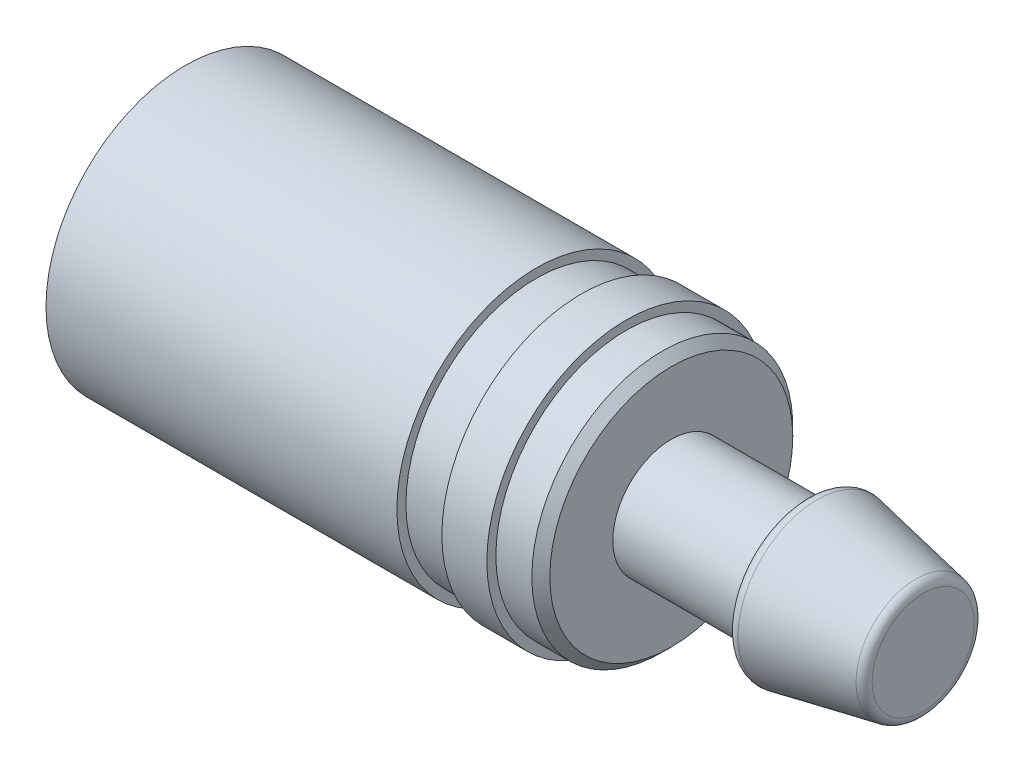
ISO-10303-21;
HEADER;
FILE_DESCRIPTION(('STEP AP214'),'2;1');
FILE_NAME('part.step','',(''),(''),'','','');
FILE_SCHEMA(('AUTOMOTIVE_DESIGN { 1 0 10303 214 1 1 1 1 }'));
ENDSEC;
DATA;
#1=APPLICATION_CONTEXT('core data for automotive mechanical design processes');
#2=APPLICATION_PROTOCOL_DEFINITION('international standard','automotive_design',2000,#1);
#3=PRODUCT_CONTEXT('',#1,'mechanical');
#4=PRODUCT('Part','Part','',(#3));
#5=PRODUCT_RELATED_PRODUCT_CATEGORY('part','',(#4));
#6=PRODUCT_DEFINITION_FORMATION('','',#4);
#7=PRODUCT_DEFINITION_CONTEXT('part definition',#1,'design');
#8=PRODUCT_DEFINITION('design','',#6,#7);
#9=PRODUCT_DEFINITION_SHAPE('','',#8);
#10=(LENGTH_UNIT() NAMED_UNIT(*) SI_UNIT(.MILLI.,.METRE.));
#11=(NAMED_UNIT(*) PLANE_ANGLE_UNIT() SI_UNIT($,.RADIAN.));
#12=(NAMED_UNIT(*) SI_UNIT($,.STERADIAN.) SOLID_ANGLE_UNIT());
#13=UNCERTAINTY_MEASURE_WITH_UNIT(LENGTH_MEASURE(1.E-05),#10,'distance_accuracy_value','');
#14=(GEOMETRIC_REPRESENTATION_CONTEXT(3) GLOBAL_UNCERTAINTY_ASSIGNED_CONTEXT((#13)) GLOBAL_UNIT_ASSIGNED_CONTEXT((#10,
#11,#12)) REPRESENTATION_CONTEXT('',''));
#15=CARTESIAN_POINT('',(0.,0.,0.));
#16=DIRECTION('',(0.,0.,1.));
#17=DIRECTION('',(1.,0.,0.));
#18=AXIS2_PLACEMENT_3D('',#15,#16,#17);
#19=CARTESIAN_POINT('',(82.,0.,0.));
#20=DIRECTION('',(-1.,0.,0.));
#21=DIRECTION('',(0.,0.,1.));
#22=AXIS2_PLACEMENT_3D('',#19,#20,#21);
#23=PLANE('',#22);
#24=CARTESIAN_POINT('',(82.,0.,0.));
#25=DIRECTION('',(-1.,0.,0.));
#26=DIRECTION('',(0.,0.,1.));
#27=AXIS2_PLACEMENT_3D('',#24,#25,#26);
#28=CIRCLE('',#27,5.67398443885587);
#29=CARTESIAN_POINT('',(82.,0.,5.67398443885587));
#30=VERTEX_POINT('',#29);
#31=EDGE_CURVE('E46',#30,#30,#28,.F.);
#32=ORIENTED_EDGE('',*,*,#31,.T.);
#33=EDGE_LOOP('',(#32));
#34=FACE_BOUND('',#33,.T.);
#35=ADVANCED_FACE('F31',(#34),#23,.F.);
#36=CARTESIAN_POINT('',(82.,0.,0.));
#37=DIRECTION('',(-1.,0.,0.));
#38=DIRECTION('',(0.,0.,1.));
#39=AXIS2_PLACEMENT_3D('',#36,#37,#38);
#40=CONICAL_SURFACE('',#39,6.5,0.189988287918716);
#41=CARTESIAN_POINT('',(81.1888473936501,0.,0.));
#42=DIRECTION('',(1.,0.,0.));
#43=DIRECTION('',(0.,0.,-1.));
#44=AXIS2_PLACEMENT_3D('',#41,#42,#43);
#45=CIRCLE('',#44,6.65599088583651);
#46=CARTESIAN_POINT('',(81.1888473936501,0.,-6.65599088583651));
#47=VERTEX_POINT('',#46);
#48=EDGE_CURVE('E51',#47,#47,#45,.F.);
#49=ORIENTED_EDGE('',*,*,#48,.T.);
#50=EDGE_LOOP('',(#49));
#51=FACE_BOUND('',#50,.T.);
#52=CARTESIAN_POINT('',(70.1888473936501,0.,0.));
#53=DIRECTION('',(1.,0.,0.));
#54=DIRECTION('',(0.,0.,-1.));
#55=AXIS2_PLACEMENT_3D('',#52,#53,#54);
#56=CIRCLE('',#55,8.77137550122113);
#57=CARTESIAN_POINT('',(70.1888473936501,0.,-8.77137550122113));
#58=VERTEX_POINT('',#57);
#59=EDGE_CURVE('E54',#58,#58,#56,.T.);
#60=ORIENTED_EDGE('',*,*,#59,.T.);
#61=EDGE_LOOP('',(#60));
#62=FACE_BOUND('',#61,.T.);
#63=ADVANCED_FACE('F133',(#51,#62),#40,.T.);
#64=CARTESIAN_POINT('',(69.,6.5,0.));
#65=DIRECTION('',(1.,0.,0.));
#66=DIRECTION('',(0.,0.,-1.));
#67=AXIS2_PLACEMENT_3D('',#64,#65,#66);
#68=PLANE('',#67);
#69=CARTESIAN_POINT('',(69.,0.,0.));
#70=DIRECTION('',(1.,0.,0.));
#71=DIRECTION('',(0.,0.,-1.));
#72=AXIS2_PLACEMENT_3D('',#69,#70,#71);
#73=CIRCLE('',#72,7.78936905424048);
#74=CARTESIAN_POINT('',(69.,0.,-7.78936905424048));
#75=VERTEX_POINT('',#74);
#76=EDGE_CURVE('E42',#75,#75,#73,.F.);
#77=ORIENTED_EDGE('',*,*,#76,.T.);
#78=EDGE_LOOP('',(#77));
#79=FACE_BOUND('',#78,.T.);
#80=CARTESIAN_POINT('',(69.,0.,0.));
#81=DIRECTION('',(-1.,0.,0.));
#82=DIRECTION('',(0.,0.,1.));
#83=AXIS2_PLACEMENT_3D('',#80,#81,#82);
#84=CIRCLE('',#83,6.5);
#85=CARTESIAN_POINT('',(69.,0.,6.5));
#86=VERTEX_POINT('',#85);
#87=EDGE_CURVE('E57',#86,#86,#84,.T.);
#88=ORIENTED_EDGE('',*,*,#87,.F.);
#89=EDGE_LOOP('',(#88));
#90=FACE_BOUND('',#89,.T.);
#91=ADVANCED_FACE('F139',(#79,#90),#68,.F.);
#92=CARTESIAN_POINT('',(0.,0.,0.));
#93=DIRECTION('',(-1.,0.,0.));
#94=DIRECTION('',(0.,0.,1.));
#95=AXIS2_PLACEMENT_3D('',#92,#93,#94);
#96=CYLINDRICAL_SURFACE('',#95,6.5);
#97=CARTESIAN_POINT('',(54.,0.,0.));
#98=DIRECTION('',(-1.,0.,0.));
#99=DIRECTION('',(0.,0.,1.));
#100=AXIS2_PLACEMENT_3D('',#97,#98,#99);
#101=CIRCLE('',#100,6.5);
#102=CARTESIAN_POINT('',(54.,0.,6.5));
#103=VERTEX_POINT('',#102);
#104=EDGE_CURVE('E60',#103,#103,#101,.T.);
#105=ORIENTED_EDGE('',*,*,#104,.F.);
#106=EDGE_LOOP('',(#105));
#107=FACE_BOUND('',#106,.T.);
#108=ORIENTED_EDGE('',*,*,#87,.T.);
#109=EDGE_LOOP('',(#108));
#110=FACE_BOUND('',#109,.T.);
#111=ADVANCED_FACE('F130',(#107,#110),#96,.T.);
#112=CARTESIAN_POINT('',(54.,14.5,0.));
#113=DIRECTION('',(-1.,0.,0.));
#114=DIRECTION('',(0.,0.,1.));
#115=AXIS2_PLACEMENT_3D('',#112,#113,#114);
#116=PLANE('',#115);
#117=CARTESIAN_POINT('',(54.,0.,0.));
#118=DIRECTION('',(-1.,0.,0.));
#119=DIRECTION('',(0.,0.,1.));
#120=AXIS2_PLACEMENT_3D('',#117,#118,#119);
#121=CIRCLE('',#120,13.5);
#122=CARTESIAN_POINT('',(54.,0.,13.5));
#123=VERTEX_POINT('',#122);
#124=EDGE_CURVE('E10',#123,#123,#121,.F.);
#125=ORIENTED_EDGE('',*,*,#124,.T.);
#126=EDGE_LOOP('',(#125));
#127=FACE_BOUND('',#126,.T.);
#128=ORIENTED_EDGE('',*,*,#104,.T.);
#129=EDGE_LOOP('',(#128));
#130=FACE_BOUND('',#129,.T.);
#131=ADVANCED_FACE('F125',(#127,#130),#116,.F.);
#132=CARTESIAN_POINT('',(0.,0.,0.));
#133=DIRECTION('',(-1.,0.,0.));
#134=DIRECTION('',(0.,0.,1.));
#135=AXIS2_PLACEMENT_3D('',#132,#133,#134);
#136=CYLINDRICAL_SURFACE('',#135,14.5);
#137=CARTESIAN_POINT('',(53.,0.,0.));
#138=DIRECTION('',(-1.,0.,0.));
#139=DIRECTION('',(0.,0.,1.));
#140=AXIS2_PLACEMENT_3D('',#137,#138,#139);
#141=CIRCLE('',#140,14.5);
#142=CARTESIAN_POINT('',(53.,0.,14.5));
#143=VERTEX_POINT('',#142);
#144=EDGE_CURVE('E38',#143,#143,#141,.T.);
#145=ORIENTED_EDGE('',*,*,#144,.T.);
#146=EDGE_LOOP('',(#145));
#147=FACE_BOUND('',#146,.T.);
#148=CARTESIAN_POINT('',(49.,0.,0.));
#149=DIRECTION('',(-1.,0.,0.));
#150=DIRECTION('',(0.,0.,1.));
#151=AXIS2_PLACEMENT_3D('',#148,#149,#150);
#152=CIRCLE('',#151,14.5);
#153=CARTESIAN_POINT('',(49.,0.,14.5));
#154=VERTEX_POINT('',#153);
#155=EDGE_CURVE('E63',#154,#154,#152,.T.);
#156=ORIENTED_EDGE('',*,*,#155,.F.);
#157=EDGE_LOOP('',(#156));
#158=FACE_BOUND('',#157,.T.);
#159=ADVANCED_FACE('F120',(#147,#158),#136,.T.);
#160=CARTESIAN_POINT('',(49.,15.5,0.));
#161=DIRECTION('',(-1.,0.,0.));
#162=DIRECTION('',(0.,0.,1.));
#163=AXIS2_PLACEMENT_3D('',#160,#161,#162);
#164=PLANE('',#163);
#165=CARTESIAN_POINT('',(49.,0.,0.));
#166=DIRECTION('',(-1.,0.,0.));
#167=DIRECTION('',(0.,0.,1.));
#168=AXIS2_PLACEMENT_3D('',#165,#166,#167);
#169=CIRCLE('',#168,15.5);
#170=CARTESIAN_POINT('',(49.,0.,15.5));
#171=VERTEX_POINT('',#170);
#172=EDGE_CURVE('E66',#171,#171,#169,.T.);
#173=ORIENTED_EDGE('',*,*,#172,.F.);
#174=EDGE_LOOP('',(#173));
#175=FACE_BOUND('',#174,.T.);
#176=ORIENTED_EDGE('',*,*,#155,.T.);
#177=EDGE_LOOP('',(#176));
#178=FACE_BOUND('',#177,.T.);
#179=ADVANCED_FACE('F114',(#175,#178),#164,.F.);
#180=CARTESIAN_POINT('',(0.,0.,0.));
#181=DIRECTION('',(-1.,0.,0.));
#182=DIRECTION('',(0.,0.,1.));
#183=AXIS2_PLACEMENT_3D('',#180,#181,#182);
#184=CYLINDRICAL_SURFACE('',#183,15.5);
#185=CARTESIAN_POINT('',(44.,0.,0.));
#186=DIRECTION('',(-1.,0.,0.));
#187=DIRECTION('',(0.,0.,1.));
#188=AXIS2_PLACEMENT_3D('',#185,#186,#187);
#189=CIRCLE('',#188,15.5);
#190=CARTESIAN_POINT('',(44.,0.,15.5));
#191=VERTEX_POINT('',#190);
#192=EDGE_CURVE('E69',#191,#191,#189,.T.);
#193=ORIENTED_EDGE('',*,*,#192,.F.);
#194=EDGE_LOOP('',(#193));
#195=FACE_BOUND('',#194,.T.);
#196=ORIENTED_EDGE('',*,*,#172,.T.);
#197=EDGE_LOOP('',(#196));
#198=FACE_BOUND('',#197,.T.);
#199=ADVANCED_FACE('F108',(#195,#198),#184,.T.);
#200=CARTESIAN_POINT('',(44.,14.5,0.));
#201=DIRECTION('',(1.,0.,0.));
#202=DIRECTION('',(0.,0.,-1.));
#203=AXIS2_PLACEMENT_3D('',#200,#201,#202);
#204=PLANE('',#203);
#205=CARTESIAN_POINT('',(44.,0.,0.));
#206=DIRECTION('',(-1.,0.,0.));
#207=DIRECTION('',(0.,0.,1.));
#208=AXIS2_PLACEMENT_3D('',#205,#206,#207);
#209=CIRCLE('',#208,14.5);
#210=CARTESIAN_POINT('',(44.,0.,14.5));
#211=VERTEX_POINT('',#210);
#212=EDGE_CURVE('E72',#211,#211,#209,.T.);
#213=ORIENTED_EDGE('',*,*,#212,.F.);
#214=EDGE_LOOP('',(#213));
#215=FACE_BOUND('',#214,.T.);
#216=ORIENTED_EDGE('',*,*,#192,.T.);
#217=EDGE_LOOP('',(#216));
#218=FACE_BOUND('',#217,.T.);
#219=ADVANCED_FACE('F102',(#215,#218),#204,.F.);
#220=CARTESIAN_POINT('',(0.,0.,0.));
#221=DIRECTION('',(-1.,0.,0.));
#222=DIRECTION('',(0.,0.,1.));
#223=AXIS2_PLACEMENT_3D('',#220,#221,#222);
#224=CYLINDRICAL_SURFACE('',#223,14.5);
#225=CARTESIAN_POINT('',(39.,0.,0.));
#226=DIRECTION('',(-1.,0.,0.));
#227=DIRECTION('',(0.,0.,1.));
#228=AXIS2_PLACEMENT_3D('',#225,#226,#227);
#229=CIRCLE('',#228,14.5);
#230=CARTESIAN_POINT('',(39.,0.,14.5));
#231=VERTEX_POINT('',#230);
#232=EDGE_CURVE('E75',#231,#231,#229,.T.);
#233=ORIENTED_EDGE('',*,*,#232,.F.);
#234=EDGE_LOOP('',(#233));
#235=FACE_BOUND('',#234,.T.);
#236=ORIENTED_EDGE('',*,*,#212,.T.);
#237=EDGE_LOOP('',(#236));
#238=FACE_BOUND('',#237,.T.);
#239=ADVANCED_FACE('F96',(#235,#238),#224,.T.);
#240=CARTESIAN_POINT('',(39.,15.5,0.));
#241=DIRECTION('',(-1.,0.,0.));
#242=DIRECTION('',(0.,0.,1.));
#243=AXIS2_PLACEMENT_3D('',#240,#241,#242);
#244=PLANE('',#243);
#245=CARTESIAN_POINT('',(39.,0.,0.));
#246=DIRECTION('',(-1.,0.,0.));
#247=DIRECTION('',(0.,0.,1.));
#248=AXIS2_PLACEMENT_3D('',#245,#246,#247);
#249=CIRCLE('',#248,15.5);
#250=CARTESIAN_POINT('',(39.,0.,15.5));
#251=VERTEX_POINT('',#250);
#252=EDGE_CURVE('E78',#251,#251,#249,.T.);
#253=ORIENTED_EDGE('',*,*,#252,.F.);
#254=EDGE_LOOP('',(#253));
#255=FACE_BOUND('',#254,.T.);
#256=ORIENTED_EDGE('',*,*,#232,.T.);
#257=EDGE_LOOP('',(#256));
#258=FACE_BOUND('',#257,.T.);
#259=ADVANCED_FACE('F90',(#255,#258),#244,.F.);
#260=CARTESIAN_POINT('',(0.,0.,0.));
#261=DIRECTION('',(-1.,0.,0.));
#262=DIRECTION('',(0.,0.,1.));
#263=AXIS2_PLACEMENT_3D('',#260,#261,#262);
#264=CYLINDRICAL_SURFACE('',#263,15.5);
#265=CARTESIAN_POINT('',(0.,0.,0.));
#266=DIRECTION('',(-1.,0.,0.));
#267=DIRECTION('',(0.,0.,1.));
#268=AXIS2_PLACEMENT_3D('',#265,#266,#267);
#269=CIRCLE('',#268,15.5);
#270=CARTESIAN_POINT('',(0.,0.,15.5));
#271=VERTEX_POINT('',#270);
#272=EDGE_CURVE('E81',#271,#271,#269,.T.);
#273=ORIENTED_EDGE('',*,*,#272,.F.);
#274=EDGE_LOOP('',(#273));
#275=FACE_BOUND('',#274,.T.);
#276=ORIENTED_EDGE('',*,*,#252,.T.);
#277=EDGE_LOOP('',(#276));
#278=FACE_BOUND('',#277,.T.);
#279=ADVANCED_FACE('F87',(#275,#278),#264,.T.);
#280=CARTESIAN_POINT('',(0.,0.,0.));
#281=DIRECTION('',(1.,0.,0.));
#282=DIRECTION('',(0.,0.,-1.));
#283=AXIS2_PLACEMENT_3D('',#280,#281,#282);
#284=PLANE('',#283);
#285=ORIENTED_EDGE('',*,*,#272,.T.);
#286=EDGE_LOOP('',(#285));
#287=FACE_BOUND('',#286,.T.);
#288=ADVANCED_FACE('F85',(#287),#284,.F.);
#289=CARTESIAN_POINT('',(81.,0.,0.));
#290=DIRECTION('',(-1.,0.,0.));
#291=DIRECTION('',(0.,0.,1.));
#292=AXIS2_PLACEMENT_3D('',#289,#290,#291);
#293=TOROIDAL_SURFACE('',#292,5.67398443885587,1.);
#294=ORIENTED_EDGE('',*,*,#31,.F.);
#295=EDGE_LOOP('',(#294));
#296=FACE_BOUND('',#295,.T.);
#297=ORIENTED_EDGE('',*,*,#48,.F.);
#298=EDGE_LOOP('',(#297));
#299=FACE_BOUND('',#298,.T.);
#300=ADVANCED_FACE('F144',(#296,#299),#293,.T.);
#301=CARTESIAN_POINT('',(70.,0.,0.));
#302=DIRECTION('',(1.,0.,0.));
#303=DIRECTION('',(0.,0.,-1.));
#304=AXIS2_PLACEMENT_3D('',#301,#302,#303);
#305=TOROIDAL_SURFACE('',#304,7.78936905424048,1.);
#306=ORIENTED_EDGE('',*,*,#59,.F.);
#307=EDGE_LOOP('',(#306));
#308=FACE_BOUND('',#307,.T.);
#309=ORIENTED_EDGE('',*,*,#76,.F.);
#310=EDGE_LOOP('',(#309));
#311=FACE_BOUND('',#310,.T.);
#312=ADVANCED_FACE('F146',(#308,#311),#305,.T.);
#313=CARTESIAN_POINT('',(53.,0.,0.));
#314=DIRECTION('',(-1.,0.,0.));
#315=DIRECTION('',(0.,0.,1.));
#316=AXIS2_PLACEMENT_3D('',#313,#314,#315);
#317=CONICAL_SURFACE('',#316,14.5,0.785398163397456);
#318=ORIENTED_EDGE('',*,*,#124,.F.);
#319=EDGE_LOOP('',(#318));
#320=FACE_BOUND('',#319,.T.);
#321=ORIENTED_EDGE('',*,*,#144,.F.);
#322=EDGE_LOOP('',(#321));
#323=FACE_BOUND('',#322,.T.);
#324=ADVANCED_FACE('F33',(#320,#323),#317,.T.);
#325=CLOSED_SHELL('',(#35,#63,#91,#111,#131,#159,#179,#199,#219,#239,#259,#279,#288,#300,#312,#324));
#326=MANIFOLD_SOLID_BREP('B2',#325);
#327=ADVANCED_BREP_SHAPE_REPRESENTATION('',(#18,#326),#14);
#328=SHAPE_DEFINITION_REPRESENTATION(#9,#327);
ENDSEC;
END-ISO-10303-21;
